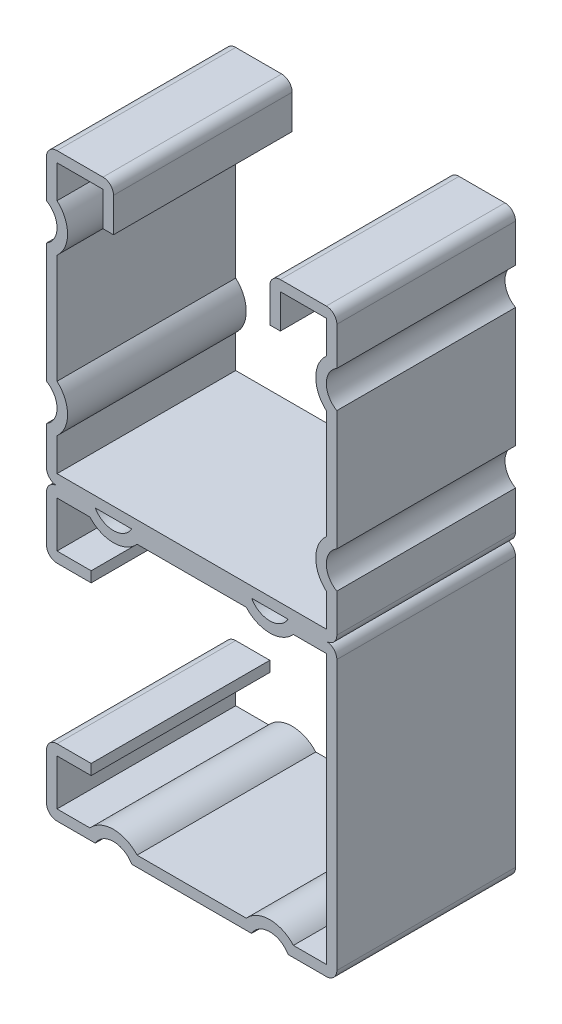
from build123d import *

# Parameters (mm, degrees)
BASE_EXTRUDE_DEPTH = 12.7
CIRPATTERN1_COUNT  = 2
CIRPATTERN1_ANGLE  = 90


with BuildPart() as part:
    # Sketch1 → Base-Extrude (new, symmetric)
    with BuildSketch(Plane.XY):
        with BuildLine():
            Line((-41.275, 39.7764), (-41.275, 34.34565134))
            ThreePointArc((-41.275, 34.34565134), (-39.7764, 31.75), (-41.275, 29.15434866))
            Line((-41.275, 29.15434866), (-41.275, 12.12065134))
            ThreePointArc((-41.275, 12.12065134), (-39.7764, 9.525), (-41.275, 6.92934866))
            Line((-41.275, 6.92934866), (-41.275, 1.4986))
            ThreePointArc((-41.275, 1.4986), (-40.836070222, 0.438929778), (-39.7764, 0))
            Line((-39.7764, 0), (-1.4986, 0))
            ThreePointArc((-1.4986, 0), (-0.438929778, 0.438929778), (0, 1.4986))
            Line((0, 1.4986), (0, 6.92934866))
            ThreePointArc((0, 6.92934866), (-1.4986, 9.525), (0, 12.12065134))
            Line((0, 12.12065134), (0, 29.15434866))
            ThreePointArc((0, 29.15434866), (-1.4986, 31.75), (0, 34.34565134))
            Line((0, 34.34565134), (0, 39.7764))
            ThreePointArc((0, 39.7764), (-0.438929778, 40.836070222), (-1.4986, 41.275))
            Line((-1.4986, 41.275), (-8.0264, 41.275))
            ThreePointArc((-8.0264, 41.275), (-9.086070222, 40.836070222), (-9.525, 39.7764))
            Line((-9.525, 39.7764), (-9.525, 34.925))
            Line((-9.525, 34.925), (-8.0264, 34.925))
            Line((-8.0264, 34.925), (-8.0264, 39.7764))
            Line((-8.0264, 39.7764), (-1.4986, 39.7764))
            Line((-1.4986, 39.7764), (-1.4986, 35.100971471))
            ThreePointArc((-1.4986, 35.100971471), (-2.9972, 31.75), (-1.4986, 28.399028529))
            Line((-1.4986, 28.399028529), (-1.4986, 12.875971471))
            ThreePointArc((-1.4986, 12.875971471), (-2.9972, 9.525), (-1.4986, 6.174028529))
            Line((-1.4986, 6.174028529), (-1.4986, 1.4986))
            Line((-1.4986, 1.4986), (-39.7764, 1.4986))
            Line((-39.7764, 1.4986), (-39.7764, 6.174028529))
            ThreePointArc((-39.7764, 6.174028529), (-38.2778, 9.525), (-39.7764, 12.875971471))
            Line((-39.7764, 12.875971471), (-39.7764, 28.399028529))
            ThreePointArc((-39.7764, 28.399028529), (-38.2778, 31.75), (-39.7764, 35.100971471))
            Line((-39.7764, 35.100971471), (-39.7764, 39.7764))
            Line((-39.7764, 39.7764), (-33.2486, 39.7764))
            Line((-33.2486, 39.7764), (-33.2486, 34.925))
            Line((-33.2486, 34.925), (-31.75, 34.925))
            Line((-31.75, 34.925), (-31.75, 39.7764))
            ThreePointArc((-31.75, 39.7764), (-32.188929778, 40.836070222), (-33.2486, 41.275))
            Line((-33.2486, 41.275), (-39.7764, 41.275))
            ThreePointArc((-39.7764, 41.275), (-40.836070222, 40.836070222), (-41.275, 39.7764))
        make_face()
    base_extrude = extrude(amount=BASE_EXTRUDE_DEPTH, both=True)

    # CirPattern1: Base-Extrude ×2 about axis
    cirpattern1_axis = Axis((0, 0, 0), (0, 0, 1))
    for i in range(1, CIRPATTERN1_COUNT):
        add(base_extrude.rotate(cirpattern1_axis, i * CIRPATTERN1_ANGLE / (CIRPATTERN1_COUNT - 1)))


solid = part.part
